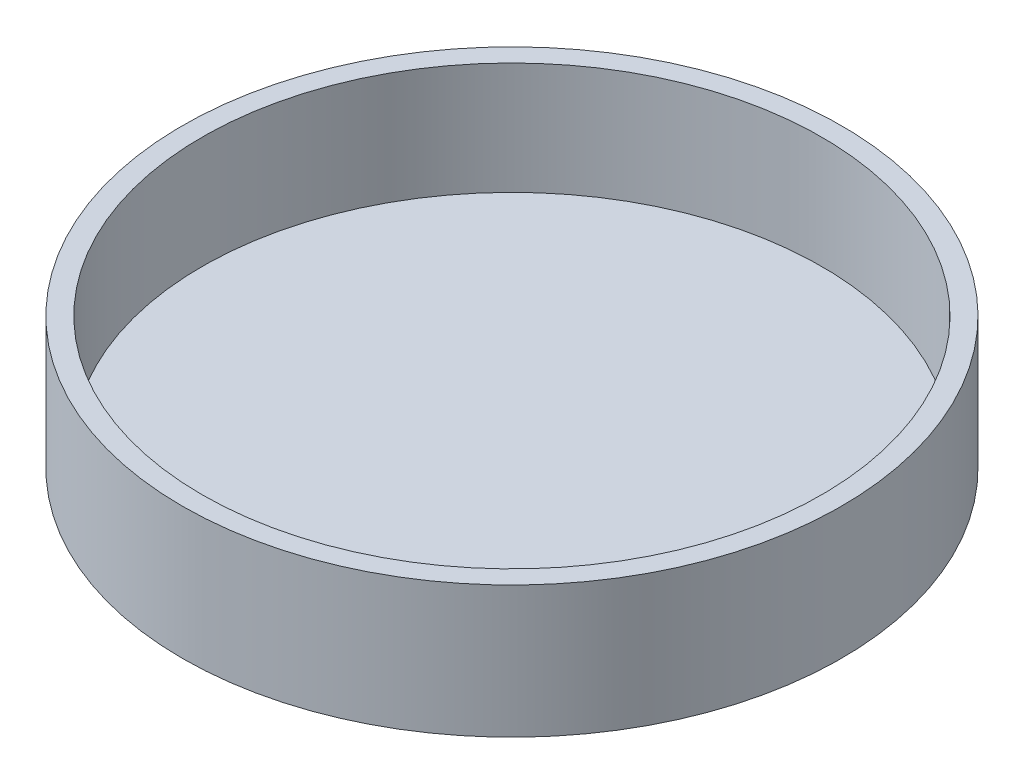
ISO-10303-21;
HEADER;
FILE_DESCRIPTION(('STEP AP214'),'2;1');
FILE_NAME('part.step','',(''),(''),'','','');
FILE_SCHEMA(('AUTOMOTIVE_DESIGN { 1 0 10303 214 1 1 1 1 }'));
ENDSEC;
DATA;
#1=APPLICATION_CONTEXT('core data for automotive mechanical design processes');
#2=APPLICATION_PROTOCOL_DEFINITION('international standard','automotive_design',2000,#1);
#3=PRODUCT_CONTEXT('',#1,'mechanical');
#4=PRODUCT('Part','Part','',(#3));
#5=PRODUCT_RELATED_PRODUCT_CATEGORY('part','',(#4));
#6=PRODUCT_DEFINITION_FORMATION('','',#4);
#7=PRODUCT_DEFINITION_CONTEXT('part definition',#1,'design');
#8=PRODUCT_DEFINITION('design','',#6,#7);
#9=PRODUCT_DEFINITION_SHAPE('','',#8);
#10=(LENGTH_UNIT() NAMED_UNIT(*) SI_UNIT(.MILLI.,.METRE.));
#11=(NAMED_UNIT(*) PLANE_ANGLE_UNIT() SI_UNIT($,.RADIAN.));
#12=(NAMED_UNIT(*) SI_UNIT($,.STERADIAN.) SOLID_ANGLE_UNIT());
#13=UNCERTAINTY_MEASURE_WITH_UNIT(LENGTH_MEASURE(1.E-05),#10,'distance_accuracy_value','');
#14=(GEOMETRIC_REPRESENTATION_CONTEXT(3) GLOBAL_UNCERTAINTY_ASSIGNED_CONTEXT((#13)) GLOBAL_UNIT_ASSIGNED_CONTEXT((#10,
#11,#12)) REPRESENTATION_CONTEXT('',''));
#15=CARTESIAN_POINT('',(0.,0.,0.));
#16=DIRECTION('',(0.,0.,1.));
#17=DIRECTION('',(1.,0.,0.));
#18=AXIS2_PLACEMENT_3D('',#15,#16,#17);
#19=CARTESIAN_POINT('',(0.,10.,0.));
#20=DIRECTION('',(0.,-1.,0.));
#21=DIRECTION('',(0.,0.,-1.));
#22=AXIS2_PLACEMENT_3D('',#19,#20,#21);
#23=CYLINDRICAL_SURFACE('',#22,25.);
#24=CARTESIAN_POINT('',(0.,10.,0.));
#25=DIRECTION('',(0.,1.,0.));
#26=DIRECTION('',(0.,0.,1.));
#27=AXIS2_PLACEMENT_3D('',#24,#25,#26);
#28=CIRCLE('',#27,25.);
#29=CARTESIAN_POINT('',(0.,10.,25.));
#30=VERTEX_POINT('',#29);
#31=EDGE_CURVE('E10',#30,#30,#28,.T.);
#32=ORIENTED_EDGE('',*,*,#31,.F.);
#33=EDGE_LOOP('',(#32));
#34=FACE_BOUND('',#33,.T.);
#35=CARTESIAN_POINT('',(0.,0.,0.));
#36=DIRECTION('',(0.,1.,0.));
#37=DIRECTION('',(0.,0.,1.));
#38=AXIS2_PLACEMENT_3D('',#35,#36,#37);
#39=CIRCLE('',#38,25.);
#40=CARTESIAN_POINT('',(0.,0.,25.));
#41=VERTEX_POINT('',#40);
#42=EDGE_CURVE('E36',#41,#41,#39,.T.);
#43=ORIENTED_EDGE('',*,*,#42,.T.);
#44=EDGE_LOOP('',(#43));
#45=FACE_BOUND('',#44,.T.);
#46=ADVANCED_FACE('F33',(#34,#45),#23,.T.);
#47=CARTESIAN_POINT('',(0.,10.,0.));
#48=DIRECTION('',(0.,1.,0.));
#49=DIRECTION('',(0.,0.,1.));
#50=AXIS2_PLACEMENT_3D('',#47,#48,#49);
#51=PLANE('',#50);
#52=CARTESIAN_POINT('',(0.,10.,0.));
#53=DIRECTION('',(0.,1.,0.));
#54=DIRECTION('',(0.,0.,1.));
#55=AXIS2_PLACEMENT_3D('',#52,#53,#54);
#56=CIRCLE('',#55,23.5);
#57=CARTESIAN_POINT('',(0.,10.,23.5));
#58=VERTEX_POINT('',#57);
#59=EDGE_CURVE('E43',#58,#58,#56,.T.);
#60=ORIENTED_EDGE('',*,*,#59,.F.);
#61=EDGE_LOOP('',(#60));
#62=FACE_BOUND('',#61,.T.);
#63=ORIENTED_EDGE('',*,*,#31,.T.);
#64=EDGE_LOOP('',(#63));
#65=FACE_BOUND('',#64,.T.);
#66=ADVANCED_FACE('F63',(#62,#65),#51,.T.);
#67=CARTESIAN_POINT('',(0.,0.,0.));
#68=DIRECTION('',(0.,1.,0.));
#69=DIRECTION('',(0.,0.,1.));
#70=AXIS2_PLACEMENT_3D('',#67,#68,#69);
#71=PLANE('',#70);
#72=ORIENTED_EDGE('',*,*,#42,.F.);
#73=EDGE_LOOP('',(#72));
#74=FACE_BOUND('',#73,.T.);
#75=ADVANCED_FACE('F55',(#74),#71,.F.);
#76=CARTESIAN_POINT('',(0.,10.,0.));
#77=DIRECTION('',(0.,-1.,0.));
#78=DIRECTION('',(0.,0.,-1.));
#79=AXIS2_PLACEMENT_3D('',#76,#77,#78);
#80=CYLINDRICAL_SURFACE('',#79,23.5);
#81=ORIENTED_EDGE('',*,*,#59,.T.);
#82=EDGE_LOOP('',(#81));
#83=FACE_BOUND('',#82,.T.);
#84=CARTESIAN_POINT('',(0.,1.5,0.));
#85=DIRECTION('',(0.,1.,0.));
#86=DIRECTION('',(0.,0.,1.));
#87=AXIS2_PLACEMENT_3D('',#84,#85,#86);
#88=CIRCLE('',#87,23.5);
#89=CARTESIAN_POINT('',(0.,1.5,23.5));
#90=VERTEX_POINT('',#89);
#91=EDGE_CURVE('E47',#90,#90,#88,.T.);
#92=ORIENTED_EDGE('',*,*,#91,.F.);
#93=EDGE_LOOP('',(#92));
#94=FACE_BOUND('',#93,.T.);
#95=ADVANCED_FACE('F53',(#83,#94),#80,.F.);
#96=CARTESIAN_POINT('',(0.,1.5,0.));
#97=DIRECTION('',(0.,1.,0.));
#98=DIRECTION('',(0.,0.,1.));
#99=AXIS2_PLACEMENT_3D('',#96,#97,#98);
#100=PLANE('',#99);
#101=ORIENTED_EDGE('',*,*,#91,.T.);
#102=EDGE_LOOP('',(#101));
#103=FACE_BOUND('',#102,.T.);
#104=ADVANCED_FACE('F51',(#103),#100,.T.);
#105=CLOSED_SHELL('',(#46,#66,#75,#95,#104));
#106=MANIFOLD_SOLID_BREP('B2',#105);
#107=ADVANCED_BREP_SHAPE_REPRESENTATION('',(#18,#106),#14);
#108=SHAPE_DEFINITION_REPRESENTATION(#9,#107);
ENDSEC;
END-ISO-10303-21;
